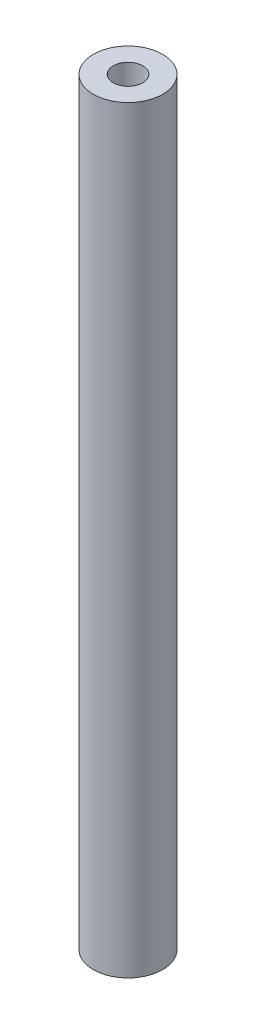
ISO-10303-21;
HEADER;
FILE_DESCRIPTION(('STEP AP214'),'2;1');
FILE_NAME('part.step','',(''),(''),'','','');
FILE_SCHEMA(('AUTOMOTIVE_DESIGN { 1 0 10303 214 1 1 1 1 }'));
ENDSEC;
DATA;
#1=APPLICATION_CONTEXT('core data for automotive mechanical design processes');
#2=APPLICATION_PROTOCOL_DEFINITION('international standard','automotive_design',2000,#1);
#3=PRODUCT_CONTEXT('',#1,'mechanical');
#4=PRODUCT('Part','Part','',(#3));
#5=PRODUCT_RELATED_PRODUCT_CATEGORY('part','',(#4));
#6=PRODUCT_DEFINITION_FORMATION('','',#4);
#7=PRODUCT_DEFINITION_CONTEXT('part definition',#1,'design');
#8=PRODUCT_DEFINITION('design','',#6,#7);
#9=PRODUCT_DEFINITION_SHAPE('','',#8);
#10=(LENGTH_UNIT() NAMED_UNIT(*) SI_UNIT(.MILLI.,.METRE.));
#11=(NAMED_UNIT(*) PLANE_ANGLE_UNIT() SI_UNIT($,.RADIAN.));
#12=(NAMED_UNIT(*) SI_UNIT($,.STERADIAN.) SOLID_ANGLE_UNIT());
#13=UNCERTAINTY_MEASURE_WITH_UNIT(LENGTH_MEASURE(1.E-05),#10,'distance_accuracy_value','');
#14=(GEOMETRIC_REPRESENTATION_CONTEXT(3) GLOBAL_UNCERTAINTY_ASSIGNED_CONTEXT((#13)) GLOBAL_UNIT_ASSIGNED_CONTEXT((#10,
#11,#12)) REPRESENTATION_CONTEXT('',''));
#15=CARTESIAN_POINT('',(0.,0.,0.));
#16=DIRECTION('',(0.,0.,1.));
#17=DIRECTION('',(1.,0.,0.));
#18=AXIS2_PLACEMENT_3D('',#15,#16,#17);
#19=CARTESIAN_POINT('',(0.,156.749999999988,0.));
#20=DIRECTION('',(0.,1.,0.));
#21=DIRECTION('',(0.,0.,1.));
#22=AXIS2_PLACEMENT_3D('',#19,#20,#21);
#23=CONICAL_SURFACE('',#22,3.39999999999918,1.02974425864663);
#24=CARTESIAN_POINT('',(0.,154.707073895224,0.));
#25=VERTEX_POINT('',#24);
#26=VERTEX_LOOP('',#25);
#27=FACE_BOUND('',#26,.T.);
#28=CARTESIAN_POINT('',(0.,156.75,0.));
#29=DIRECTION('',(0.,1.,0.));
#30=DIRECTION('',(0.,0.,1.));
#31=AXIS2_PLACEMENT_3D('',#28,#29,#30);
#32=CIRCLE('',#31,3.39999999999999);
#33=CARTESIAN_POINT('',(0.,156.75,3.39999999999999));
#34=VERTEX_POINT('',#33);
#35=EDGE_CURVE('E37',#34,#34,#32,.T.);
#36=ORIENTED_EDGE('',*,*,#35,.T.);
#37=EDGE_LOOP('',(#36));
#38=FACE_BOUND('',#37,.T.);
#39=ADVANCED_FACE('F17',(#27,#38),#23,.F.);
#40=CARTESIAN_POINT('',(0.,18.25000000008,0.));
#41=DIRECTION('',(0.,-1.,0.));
#42=DIRECTION('',(0.,0.,-1.));
#43=AXIS2_PLACEMENT_3D('',#40,#41,#42);
#44=CONICAL_SURFACE('',#43,3.39999999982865,1.02974425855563);
#45=CARTESIAN_POINT('',(0.,20.2929261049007,8.5265128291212E-11));
#46=VERTEX_POINT('',#45);
#47=VERTEX_LOOP('',#46);
#48=FACE_BOUND('',#47,.T.);
#49=CARTESIAN_POINT('',(0.,18.25,0.));
#50=DIRECTION('',(0.,-1.,0.));
#51=DIRECTION('',(0.,0.,-1.));
#52=AXIS2_PLACEMENT_3D('',#49,#50,#51);
#53=CIRCLE('',#52,3.39999999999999);
#54=CARTESIAN_POINT('',(0.,18.25,-3.39999999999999));
#55=VERTEX_POINT('',#54);
#56=EDGE_CURVE('E39',#55,#55,#53,.T.);
#57=ORIENTED_EDGE('',*,*,#56,.T.);
#58=EDGE_LOOP('',(#57));
#59=FACE_BOUND('',#58,.T.);
#60=ADVANCED_FACE('F34',(#48,#59),#44,.F.);
#61=CARTESIAN_POINT('',(0.,175.,0.));
#62=DIRECTION('',(0.,1.,0.));
#63=DIRECTION('',(0.,0.,1.));
#64=AXIS2_PLACEMENT_3D('',#61,#62,#63);
#65=CYLINDRICAL_SURFACE('',#64,3.39999999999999);
#66=CARTESIAN_POINT('',(0.,175.,0.));
#67=DIRECTION('',(0.,1.,0.));
#68=DIRECTION('',(0.,0.,1.));
#69=AXIS2_PLACEMENT_3D('',#66,#67,#68);
#70=CIRCLE('',#69,3.39999999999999);
#71=CARTESIAN_POINT('',(0.,175.,3.39999999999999));
#72=VERTEX_POINT('',#71);
#73=EDGE_CURVE('E20',#72,#72,#70,.F.);
#74=ORIENTED_EDGE('',*,*,#73,.F.);
#75=EDGE_LOOP('',(#74));
#76=FACE_BOUND('',#75,.T.);
#77=ORIENTED_EDGE('',*,*,#35,.F.);
#78=EDGE_LOOP('',(#77));
#79=FACE_BOUND('',#78,.T.);
#80=ADVANCED_FACE('F54',(#76,#79),#65,.F.);
#81=CARTESIAN_POINT('',(0.,0.,0.));
#82=DIRECTION('',(0.,-1.,0.));
#83=DIRECTION('',(0.,0.,-1.));
#84=AXIS2_PLACEMENT_3D('',#81,#82,#83);
#85=CYLINDRICAL_SURFACE('',#84,3.39999999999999);
#86=ORIENTED_EDGE('',*,*,#56,.F.);
#87=EDGE_LOOP('',(#86));
#88=FACE_BOUND('',#87,.T.);
#89=CARTESIAN_POINT('',(0.,0.,0.));
#90=DIRECTION('',(0.,-1.,0.));
#91=DIRECTION('',(0.,0.,-1.));
#92=AXIS2_PLACEMENT_3D('',#89,#90,#91);
#93=CIRCLE('',#92,3.39999999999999);
#94=CARTESIAN_POINT('',(0.,0.,-3.39999999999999));
#95=VERTEX_POINT('',#94);
#96=EDGE_CURVE('E45',#95,#95,#93,.T.);
#97=ORIENTED_EDGE('',*,*,#96,.T.);
#98=EDGE_LOOP('',(#97));
#99=FACE_BOUND('',#98,.T.);
#100=ADVANCED_FACE('F56',(#88,#99),#85,.F.);
#101=CARTESIAN_POINT('',(0.,175.,0.));
#102=DIRECTION('',(0.,1.,0.));
#103=DIRECTION('',(0.,0.,1.));
#104=AXIS2_PLACEMENT_3D('',#101,#102,#103);
#105=PLANE('',#104);
#106=CARTESIAN_POINT('',(0.,175.,0.));
#107=DIRECTION('',(0.,-1.,0.));
#108=DIRECTION('',(0.,0.,-1.));
#109=AXIS2_PLACEMENT_3D('',#106,#107,#108);
#110=CIRCLE('',#109,8.);
#111=CARTESIAN_POINT('',(0.,175.,-8.));
#112=VERTEX_POINT('',#111);
#113=EDGE_CURVE('E26',#112,#112,#110,.T.);
#114=ORIENTED_EDGE('',*,*,#113,.F.);
#115=EDGE_LOOP('',(#114));
#116=FACE_BOUND('',#115,.T.);
#117=ORIENTED_EDGE('',*,*,#73,.T.);
#118=EDGE_LOOP('',(#117));
#119=FACE_BOUND('',#118,.T.);
#120=ADVANCED_FACE('F52',(#116,#119),#105,.T.);
#121=CARTESIAN_POINT('',(0.,0.,0.));
#122=DIRECTION('',(0.,1.,0.));
#123=DIRECTION('',(0.,0.,1.));
#124=AXIS2_PLACEMENT_3D('',#121,#122,#123);
#125=PLANE('',#124);
#126=CARTESIAN_POINT('',(0.,0.,0.));
#127=DIRECTION('',(0.,-1.,0.));
#128=DIRECTION('',(0.,0.,-1.));
#129=AXIS2_PLACEMENT_3D('',#126,#127,#128);
#130=CIRCLE('',#129,8.);
#131=CARTESIAN_POINT('',(0.,0.,-8.));
#132=VERTEX_POINT('',#131);
#133=EDGE_CURVE('E11',#132,#132,#130,.F.);
#134=ORIENTED_EDGE('',*,*,#133,.F.);
#135=EDGE_LOOP('',(#134));
#136=FACE_BOUND('',#135,.T.);
#137=ORIENTED_EDGE('',*,*,#96,.F.);
#138=EDGE_LOOP('',(#137));
#139=FACE_BOUND('',#138,.T.);
#140=ADVANCED_FACE('F67',(#136,#139),#125,.F.);
#141=CARTESIAN_POINT('',(0.,175.,0.));
#142=DIRECTION('',(0.,-1.,0.));
#143=DIRECTION('',(0.,0.,-1.));
#144=AXIS2_PLACEMENT_3D('',#141,#142,#143);
#145=CYLINDRICAL_SURFACE('',#144,8.);
#146=ORIENTED_EDGE('',*,*,#133,.T.);
#147=EDGE_LOOP('',(#146));
#148=FACE_BOUND('',#147,.T.);
#149=ORIENTED_EDGE('',*,*,#113,.T.);
#150=EDGE_LOOP('',(#149));
#151=FACE_BOUND('',#150,.T.);
#152=ADVANCED_FACE('F65',(#148,#151),#145,.T.);
#153=CLOSED_SHELL('',(#39,#60,#80,#100,#120,#140,#152));
#154=MANIFOLD_SOLID_BREP('B1',#153);
#155=ADVANCED_BREP_SHAPE_REPRESENTATION('',(#18,#154),#14);
#156=SHAPE_DEFINITION_REPRESENTATION(#9,#155);
ENDSEC;
END-ISO-10303-21;
